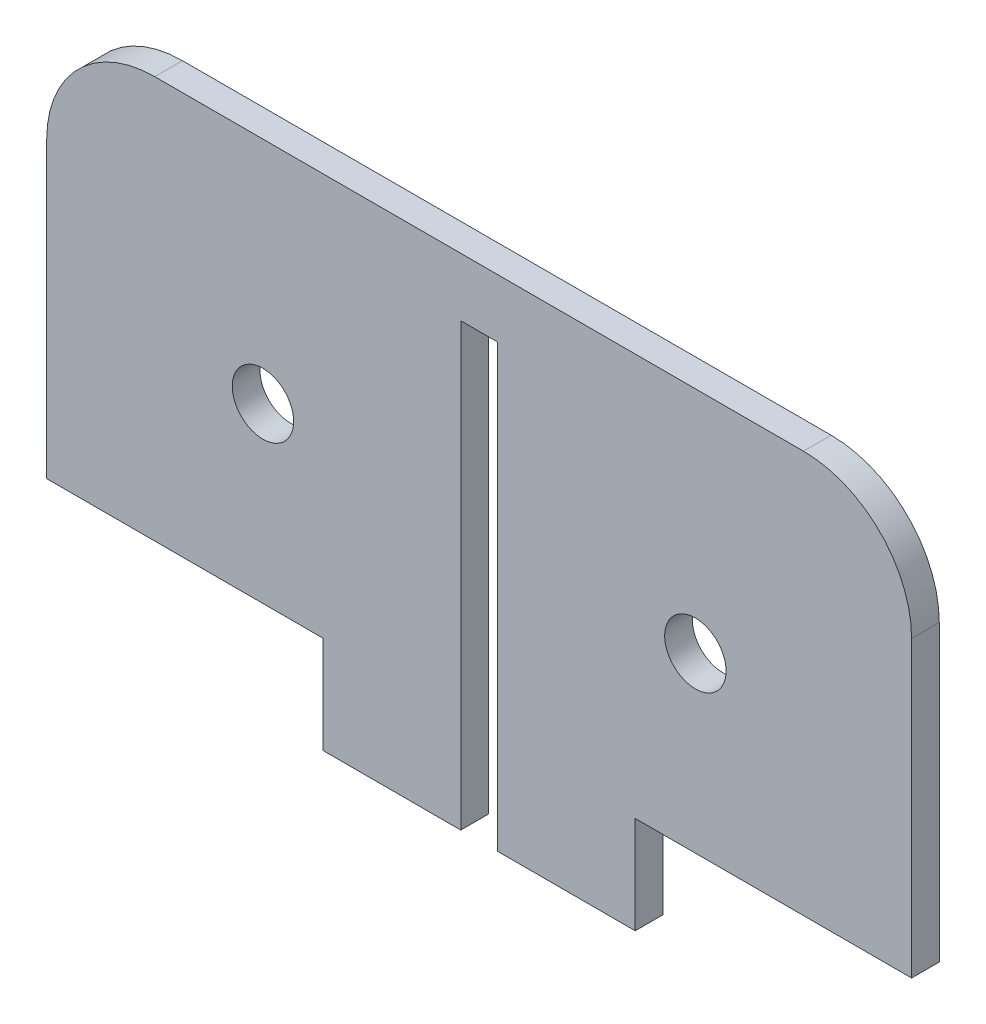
ISO-10303-21;
HEADER;
FILE_DESCRIPTION(('STEP AP214'),'2;1');
FILE_NAME('part.step','',(''),(''),'','','');
FILE_SCHEMA(('AUTOMOTIVE_DESIGN { 1 0 10303 214 1 1 1 1 }'));
ENDSEC;
DATA;
#1=APPLICATION_CONTEXT('core data for automotive mechanical design processes');
#2=APPLICATION_PROTOCOL_DEFINITION('international standard','automotive_design',2000,#1);
#3=PRODUCT_CONTEXT('',#1,'mechanical');
#4=PRODUCT('Part','Part','',(#3));
#5=PRODUCT_RELATED_PRODUCT_CATEGORY('part','',(#4));
#6=PRODUCT_DEFINITION_FORMATION('','',#4);
#7=PRODUCT_DEFINITION_CONTEXT('part definition',#1,'design');
#8=PRODUCT_DEFINITION('design','',#6,#7);
#9=PRODUCT_DEFINITION_SHAPE('','',#8);
#10=(LENGTH_UNIT() NAMED_UNIT(*) SI_UNIT(.MILLI.,.METRE.));
#11=(NAMED_UNIT(*) PLANE_ANGLE_UNIT() SI_UNIT($,.RADIAN.));
#12=(NAMED_UNIT(*) SI_UNIT($,.STERADIAN.) SOLID_ANGLE_UNIT());
#13=UNCERTAINTY_MEASURE_WITH_UNIT(LENGTH_MEASURE(1.E-05),#10,'distance_accuracy_value','');
#14=(GEOMETRIC_REPRESENTATION_CONTEXT(3) GLOBAL_UNCERTAINTY_ASSIGNED_CONTEXT((#13)) GLOBAL_UNIT_ASSIGNED_CONTEXT((#10,
#11,#12)) REPRESENTATION_CONTEXT('',''));
#15=CARTESIAN_POINT('',(0.,0.,0.));
#16=DIRECTION('',(0.,0.,1.));
#17=DIRECTION('',(1.,0.,0.));
#18=AXIS2_PLACEMENT_3D('',#15,#16,#17);
#19=CARTESIAN_POINT('',(63.90625,22.5,-6.4));
#20=DIRECTION('',(0.,-1.,0.));
#21=DIRECTION('',(1.,0.,0.));
#22=AXIS2_PLACEMENT_3D('',#19,#20,#21);
#23=PLANE('',#22);
#24=DIRECTION('',(1.,0.,0.));
#25=VECTOR('',#24,1.);
#26=CARTESIAN_POINT('',(63.90625,22.5,0.));
#27=LINE('',#26,#25);
#28=CARTESIAN_POINT('',(0.,22.5,0.));
#29=VERTEX_POINT('',#28);
#30=CARTESIAN_POINT('',(63.90625,22.5,0.));
#31=VERTEX_POINT('',#30);
#32=EDGE_CURVE('E166',#29,#31,#27,.T.);
#33=ORIENTED_EDGE('',*,*,#32,.F.);
#34=DIRECTION('',(0.,0.,1.));
#35=VECTOR('',#34,1.);
#36=CARTESIAN_POINT('',(0.,22.5,-6.4));
#37=LINE('',#36,#35);
#38=CARTESIAN_POINT('',(0.,22.5,-6.4));
#39=VERTEX_POINT('',#38);
#40=EDGE_CURVE('E11',#39,#29,#37,.T.);
#41=ORIENTED_EDGE('',*,*,#40,.F.);
#42=DIRECTION('',(1.,0.,0.));
#43=VECTOR('',#42,1.);
#44=CARTESIAN_POINT('',(63.90625,22.5,-6.4));
#45=LINE('',#44,#43);
#46=CARTESIAN_POINT('',(63.90625,22.5,-6.4));
#47=VERTEX_POINT('',#46);
#48=EDGE_CURVE('E205',#39,#47,#45,.T.);
#49=ORIENTED_EDGE('',*,*,#48,.T.);
#50=DIRECTION('',(0.,0.,1.));
#51=VECTOR('',#50,1.);
#52=CARTESIAN_POINT('',(63.90625,22.5,-6.4));
#53=LINE('',#52,#51);
#54=EDGE_CURVE('E36',#47,#31,#53,.T.);
#55=ORIENTED_EDGE('',*,*,#54,.T.);
#56=EDGE_LOOP('',(#33,#41,#49,#55));
#57=FACE_BOUND('',#56,.T.);
#58=ADVANCED_FACE('F33',(#57),#23,.T.);
#59=CARTESIAN_POINT('',(0.,22.5,-6.4));
#60=DIRECTION('',(-1.,0.,0.));
#61=DIRECTION('',(0.,-1.,0.));
#62=AXIS2_PLACEMENT_3D('',#59,#60,#61);
#63=PLANE('',#62);
#64=DIRECTION('',(0.,-1.,0.));
#65=VECTOR('',#64,1.);
#66=CARTESIAN_POINT('',(0.,22.5,0.));
#67=LINE('',#66,#65);
#68=CARTESIAN_POINT('',(0.,90.5,0.));
#69=VERTEX_POINT('',#68);
#70=EDGE_CURVE('E203',#69,#29,#67,.T.);
#71=ORIENTED_EDGE('',*,*,#70,.F.);
#72=DIRECTION('',(0.,0.,1.));
#73=VECTOR('',#72,1.);
#74=CARTESIAN_POINT('',(0.,90.5,-6.4));
#75=LINE('',#74,#73);
#76=CARTESIAN_POINT('',(0.,90.5,-6.4));
#77=VERTEX_POINT('',#76);
#78=EDGE_CURVE('E42',#77,#69,#75,.T.);
#79=ORIENTED_EDGE('',*,*,#78,.F.);
#80=DIRECTION('',(0.,-1.,0.));
#81=VECTOR('',#80,1.);
#82=CARTESIAN_POINT('',(0.,22.5,-6.4));
#83=LINE('',#82,#81);
#84=EDGE_CURVE('E156',#77,#39,#83,.T.);
#85=ORIENTED_EDGE('',*,*,#84,.T.);
#86=ORIENTED_EDGE('',*,*,#40,.T.);
#87=EDGE_LOOP('',(#71,#79,#85,#86));
#88=FACE_BOUND('',#87,.T.);
#89=ADVANCED_FACE('F229',(#88),#63,.T.);
#90=CARTESIAN_POINT('',(25.0000001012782,90.4999998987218,-6.4));
#91=DIRECTION('',(0.,0.,1.));
#92=DIRECTION('',(1.,0.,0.));
#93=AXIS2_PLACEMENT_3D('',#90,#91,#92);
#94=CYLINDRICAL_SURFACE('',#93,25.0000001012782);
#95=CARTESIAN_POINT('',(25.0000001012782,90.4999998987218,0.));
#96=DIRECTION('',(0.,0.,1.));
#97=DIRECTION('',(1.,0.,0.));
#98=AXIS2_PLACEMENT_3D('',#95,#96,#97);
#99=CIRCLE('',#98,25.0000001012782);
#100=CARTESIAN_POINT('',(25.,115.5,0.));
#101=VERTEX_POINT('',#100);
#102=EDGE_CURVE('E143',#101,#69,#99,.T.);
#103=ORIENTED_EDGE('',*,*,#102,.F.);
#104=DIRECTION('',(0.,0.,1.));
#105=VECTOR('',#104,1.);
#106=CARTESIAN_POINT('',(25.,115.5,-6.4));
#107=LINE('',#106,#105);
#108=CARTESIAN_POINT('',(25.,115.5,-6.4));
#109=VERTEX_POINT('',#108);
#110=EDGE_CURVE('E138',#109,#101,#107,.T.);
#111=ORIENTED_EDGE('',*,*,#110,.F.);
#112=CARTESIAN_POINT('',(25.0000001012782,90.4999998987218,-6.4));
#113=DIRECTION('',(0.,0.,1.));
#114=DIRECTION('',(1.,0.,0.));
#115=AXIS2_PLACEMENT_3D('',#112,#113,#114);
#116=CIRCLE('',#115,25.0000001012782);
#117=EDGE_CURVE('E141',#109,#77,#116,.T.);
#118=ORIENTED_EDGE('',*,*,#117,.T.);
#119=ORIENTED_EDGE('',*,*,#78,.T.);
#120=EDGE_LOOP('',(#103,#111,#118,#119));
#121=FACE_BOUND('',#120,.T.);
#122=ADVANCED_FACE('F140',(#121),#94,.T.);
#123=CARTESIAN_POINT('',(25.,115.5,-6.4));
#124=DIRECTION('',(0.,1.,0.));
#125=DIRECTION('',(0.,0.,1.));
#126=AXIS2_PLACEMENT_3D('',#123,#124,#125);
#127=PLANE('',#126);
#128=DIRECTION('',(-1.,0.,0.));
#129=VECTOR('',#128,1.);
#130=CARTESIAN_POINT('',(25.,115.5,0.));
#131=LINE('',#130,#129);
#132=CARTESIAN_POINT('',(175.,115.5,0.));
#133=VERTEX_POINT('',#132);
#134=EDGE_CURVE('E200',#133,#101,#131,.T.);
#135=ORIENTED_EDGE('',*,*,#134,.F.);
#136=DIRECTION('',(0.,0.,1.));
#137=VECTOR('',#136,1.);
#138=CARTESIAN_POINT('',(175.,115.5,-6.4));
#139=LINE('',#138,#137);
#140=CARTESIAN_POINT('',(175.,115.5,-6.4));
#141=VERTEX_POINT('',#140);
#142=EDGE_CURVE('E148',#141,#133,#139,.T.);
#143=ORIENTED_EDGE('',*,*,#142,.F.);
#144=DIRECTION('',(-1.,0.,0.));
#145=VECTOR('',#144,1.);
#146=CARTESIAN_POINT('',(25.,115.5,-6.4));
#147=LINE('',#146,#145);
#148=EDGE_CURVE('E154',#141,#109,#147,.T.);
#149=ORIENTED_EDGE('',*,*,#148,.T.);
#150=ORIENTED_EDGE('',*,*,#110,.T.);
#151=EDGE_LOOP('',(#135,#143,#149,#150));
#152=FACE_BOUND('',#151,.T.);
#153=ADVANCED_FACE('F158',(#152),#127,.T.);
#154=CARTESIAN_POINT('',(174.999999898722,90.4999998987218,-6.4));
#155=DIRECTION('',(0.,0.,1.));
#156=DIRECTION('',(1.,0.,0.));
#157=AXIS2_PLACEMENT_3D('',#154,#155,#156);
#158=CYLINDRICAL_SURFACE('',#157,25.0000001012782);
#159=CARTESIAN_POINT('',(174.999999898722,90.4999998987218,0.));
#160=DIRECTION('',(0.,0.,1.));
#161=DIRECTION('',(1.,0.,0.));
#162=AXIS2_PLACEMENT_3D('',#159,#160,#161);
#163=CIRCLE('',#162,25.0000001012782);
#164=CARTESIAN_POINT('',(200.,90.5,0.));
#165=VERTEX_POINT('',#164);
#166=EDGE_CURVE('E197',#165,#133,#163,.T.);
#167=ORIENTED_EDGE('',*,*,#166,.F.);
#168=DIRECTION('',(0.,0.,1.));
#169=VECTOR('',#168,1.);
#170=CARTESIAN_POINT('',(200.,90.5,-6.4));
#171=LINE('',#170,#169);
#172=CARTESIAN_POINT('',(200.,90.5,-6.4));
#173=VERTEX_POINT('',#172);
#174=EDGE_CURVE('E209',#173,#165,#171,.T.);
#175=ORIENTED_EDGE('',*,*,#174,.F.);
#176=CARTESIAN_POINT('',(174.999999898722,90.4999998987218,-6.4));
#177=DIRECTION('',(0.,0.,1.));
#178=DIRECTION('',(1.,0.,0.));
#179=AXIS2_PLACEMENT_3D('',#176,#177,#178);
#180=CIRCLE('',#179,25.0000001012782);
#181=EDGE_CURVE('E159',#173,#141,#180,.T.);
#182=ORIENTED_EDGE('',*,*,#181,.T.);
#183=ORIENTED_EDGE('',*,*,#142,.T.);
#184=EDGE_LOOP('',(#167,#175,#182,#183));
#185=FACE_BOUND('',#184,.T.);
#186=ADVANCED_FACE('F242',(#185),#158,.T.);
#187=CARTESIAN_POINT('',(200.,90.5,-6.4));
#188=DIRECTION('',(1.,0.,0.));
#189=DIRECTION('',(0.,0.,-1.));
#190=AXIS2_PLACEMENT_3D('',#187,#188,#189);
#191=PLANE('',#190);
#192=DIRECTION('',(0.,1.,0.));
#193=VECTOR('',#192,1.);
#194=CARTESIAN_POINT('',(200.,90.5,0.));
#195=LINE('',#194,#193);
#196=CARTESIAN_POINT('',(200.,22.5,0.));
#197=VERTEX_POINT('',#196);
#198=EDGE_CURVE('E194',#197,#165,#195,.T.);
#199=ORIENTED_EDGE('',*,*,#198,.F.);
#200=DIRECTION('',(0.,0.,1.));
#201=VECTOR('',#200,1.);
#202=CARTESIAN_POINT('',(200.,22.5,-6.4));
#203=LINE('',#202,#201);
#204=CARTESIAN_POINT('',(200.,22.5,-6.4));
#205=VERTEX_POINT('',#204);
#206=EDGE_CURVE('E211',#205,#197,#203,.T.);
#207=ORIENTED_EDGE('',*,*,#206,.F.);
#208=DIRECTION('',(0.,1.,0.));
#209=VECTOR('',#208,1.);
#210=CARTESIAN_POINT('',(200.,90.5,-6.4));
#211=LINE('',#210,#209);
#212=EDGE_CURVE('E161',#205,#173,#211,.T.);
#213=ORIENTED_EDGE('',*,*,#212,.T.);
#214=ORIENTED_EDGE('',*,*,#174,.T.);
#215=EDGE_LOOP('',(#199,#207,#213,#214));
#216=FACE_BOUND('',#215,.T.);
#217=ADVANCED_FACE('F245',(#216),#191,.T.);
#218=CARTESIAN_POINT('',(200.,22.5,-6.4));
#219=DIRECTION('',(0.,-1.,0.));
#220=DIRECTION('',(1.,0.,0.));
#221=AXIS2_PLACEMENT_3D('',#218,#219,#220);
#222=PLANE('',#221);
#223=DIRECTION('',(1.,0.,0.));
#224=VECTOR('',#223,1.);
#225=CARTESIAN_POINT('',(200.,22.5,0.));
#226=LINE('',#225,#224);
#227=CARTESIAN_POINT('',(136.09375,22.5,0.));
#228=VERTEX_POINT('',#227);
#229=EDGE_CURVE('E191',#228,#197,#226,.T.);
#230=ORIENTED_EDGE('',*,*,#229,.F.);
#231=DIRECTION('',(0.,0.,1.));
#232=VECTOR('',#231,1.);
#233=CARTESIAN_POINT('',(136.09375,22.5,-6.4));
#234=LINE('',#233,#232);
#235=CARTESIAN_POINT('',(136.09375,22.5,-6.4));
#236=VERTEX_POINT('',#235);
#237=EDGE_CURVE('E213',#236,#228,#234,.T.);
#238=ORIENTED_EDGE('',*,*,#237,.F.);
#239=DIRECTION('',(1.,0.,0.));
#240=VECTOR('',#239,1.);
#241=CARTESIAN_POINT('',(200.,22.5,-6.4));
#242=LINE('',#241,#240);
#243=EDGE_CURVE('E333',#236,#205,#242,.T.);
#244=ORIENTED_EDGE('',*,*,#243,.T.);
#245=ORIENTED_EDGE('',*,*,#206,.T.);
#246=EDGE_LOOP('',(#230,#238,#244,#245));
#247=FACE_BOUND('',#246,.T.);
#248=ADVANCED_FACE('F249',(#247),#222,.T.);
#249=CARTESIAN_POINT('',(136.09375,22.5,-6.4));
#250=DIRECTION('',(1.,0.,0.));
#251=DIRECTION('',(0.,0.,-1.));
#252=AXIS2_PLACEMENT_3D('',#249,#250,#251);
#253=PLANE('',#252);
#254=DIRECTION('',(0.,1.,0.));
#255=VECTOR('',#254,1.);
#256=CARTESIAN_POINT('',(136.09375,22.5,0.));
#257=LINE('',#256,#255);
#258=CARTESIAN_POINT('',(136.09375,0.,0.));
#259=VERTEX_POINT('',#258);
#260=EDGE_CURVE('E188',#259,#228,#257,.T.);
#261=ORIENTED_EDGE('',*,*,#260,.F.);
#262=DIRECTION('',(0.,0.,1.));
#263=VECTOR('',#262,1.);
#264=CARTESIAN_POINT('',(136.09375,0.,-6.4));
#265=LINE('',#264,#263);
#266=CARTESIAN_POINT('',(136.09375,0.,-6.4));
#267=VERTEX_POINT('',#266);
#268=EDGE_CURVE('E215',#267,#259,#265,.T.);
#269=ORIENTED_EDGE('',*,*,#268,.F.);
#270=DIRECTION('',(0.,1.,0.));
#271=VECTOR('',#270,1.);
#272=CARTESIAN_POINT('',(136.09375,22.5,-6.4));
#273=LINE('',#272,#271);
#274=EDGE_CURVE('E330',#267,#236,#273,.T.);
#275=ORIENTED_EDGE('',*,*,#274,.T.);
#276=ORIENTED_EDGE('',*,*,#237,.T.);
#277=EDGE_LOOP('',(#261,#269,#275,#276));
#278=FACE_BOUND('',#277,.T.);
#279=ADVANCED_FACE('F253',(#278),#253,.T.);
#280=CARTESIAN_POINT('',(136.09375,0.,-6.4));
#281=DIRECTION('',(0.,-1.,0.));
#282=DIRECTION('',(1.,0.,0.));
#283=AXIS2_PLACEMENT_3D('',#280,#281,#282);
#284=PLANE('',#283);
#285=DIRECTION('',(1.,0.,0.));
#286=VECTOR('',#285,1.);
#287=CARTESIAN_POINT('',(136.09375,0.,0.));
#288=LINE('',#287,#286);
#289=CARTESIAN_POINT('',(104.25,0.,0.));
#290=VERTEX_POINT('',#289);
#291=EDGE_CURVE('E185',#290,#259,#288,.T.);
#292=ORIENTED_EDGE('',*,*,#291,.F.);
#293=DIRECTION('',(0.,0.,1.));
#294=VECTOR('',#293,1.);
#295=CARTESIAN_POINT('',(104.25,0.,-6.4));
#296=LINE('',#295,#294);
#297=CARTESIAN_POINT('',(104.25,0.,-6.4));
#298=VERTEX_POINT('',#297);
#299=EDGE_CURVE('E217',#298,#290,#296,.T.);
#300=ORIENTED_EDGE('',*,*,#299,.F.);
#301=DIRECTION('',(1.,0.,0.));
#302=VECTOR('',#301,1.);
#303=CARTESIAN_POINT('',(136.09375,0.,-6.4));
#304=LINE('',#303,#302);
#305=EDGE_CURVE('E327',#298,#267,#304,.T.);
#306=ORIENTED_EDGE('',*,*,#305,.T.);
#307=ORIENTED_EDGE('',*,*,#268,.T.);
#308=EDGE_LOOP('',(#292,#300,#306,#307));
#309=FACE_BOUND('',#308,.T.);
#310=ADVANCED_FACE('F257',(#309),#284,.T.);
#311=CARTESIAN_POINT('',(104.25,0.,-6.4));
#312=DIRECTION('',(-1.,0.,0.));
#313=DIRECTION('',(0.,-1.,0.));
#314=AXIS2_PLACEMENT_3D('',#311,#312,#313);
#315=PLANE('',#314);
#316=DIRECTION('',(0.,-1.,0.));
#317=VECTOR('',#316,1.);
#318=CARTESIAN_POINT('',(104.25,0.,0.));
#319=LINE('',#318,#317);
#320=CARTESIAN_POINT('',(104.25,102.,0.));
#321=VERTEX_POINT('',#320);
#322=EDGE_CURVE('E182',#321,#290,#319,.T.);
#323=ORIENTED_EDGE('',*,*,#322,.F.);
#324=DIRECTION('',(0.,0.,1.));
#325=VECTOR('',#324,1.);
#326=CARTESIAN_POINT('',(104.25,102.,-6.4));
#327=LINE('',#326,#325);
#328=CARTESIAN_POINT('',(104.25,102.,-6.4));
#329=VERTEX_POINT('',#328);
#330=EDGE_CURVE('E219',#329,#321,#327,.T.);
#331=ORIENTED_EDGE('',*,*,#330,.F.);
#332=DIRECTION('',(0.,-1.,0.));
#333=VECTOR('',#332,1.);
#334=CARTESIAN_POINT('',(104.25,0.,-6.4));
#335=LINE('',#334,#333);
#336=EDGE_CURVE('E324',#329,#298,#335,.T.);
#337=ORIENTED_EDGE('',*,*,#336,.T.);
#338=ORIENTED_EDGE('',*,*,#299,.T.);
#339=EDGE_LOOP('',(#323,#331,#337,#338));
#340=FACE_BOUND('',#339,.T.);
#341=ADVANCED_FACE('F261',(#340),#315,.T.);
#342=CARTESIAN_POINT('',(104.25,102.,-6.4));
#343=DIRECTION('',(0.,-1.,0.));
#344=DIRECTION('',(0.,0.,-1.));
#345=AXIS2_PLACEMENT_3D('',#342,#343,#344);
#346=PLANE('',#345);
#347=DIRECTION('',(1.,0.,0.));
#348=VECTOR('',#347,1.);
#349=CARTESIAN_POINT('',(104.25,102.,0.));
#350=LINE('',#349,#348);
#351=CARTESIAN_POINT('',(95.7500000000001,102.,0.));
#352=VERTEX_POINT('',#351);
#353=EDGE_CURVE('E179',#352,#321,#350,.T.);
#354=ORIENTED_EDGE('',*,*,#353,.F.);
#355=DIRECTION('',(0.,0.,1.));
#356=VECTOR('',#355,1.);
#357=CARTESIAN_POINT('',(95.7500000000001,102.,-6.4));
#358=LINE('',#357,#356);
#359=CARTESIAN_POINT('',(95.7500000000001,102.,-6.4));
#360=VERTEX_POINT('',#359);
#361=EDGE_CURVE('E221',#360,#352,#358,.T.);
#362=ORIENTED_EDGE('',*,*,#361,.F.);
#363=DIRECTION('',(1.,0.,0.));
#364=VECTOR('',#363,1.);
#365=CARTESIAN_POINT('',(104.25,102.,-6.4));
#366=LINE('',#365,#364);
#367=EDGE_CURVE('E321',#360,#329,#366,.T.);
#368=ORIENTED_EDGE('',*,*,#367,.T.);
#369=ORIENTED_EDGE('',*,*,#330,.T.);
#370=EDGE_LOOP('',(#354,#362,#368,#369));
#371=FACE_BOUND('',#370,.T.);
#372=ADVANCED_FACE('F265',(#371),#346,.T.);
#373=CARTESIAN_POINT('',(95.7500000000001,102.,-6.4));
#374=DIRECTION('',(1.,0.,0.));
#375=DIRECTION('',(0.,0.,-1.));
#376=AXIS2_PLACEMENT_3D('',#373,#374,#375);
#377=PLANE('',#376);
#378=DIRECTION('',(0.,1.,0.));
#379=VECTOR('',#378,1.);
#380=CARTESIAN_POINT('',(95.7500000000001,102.,0.));
#381=LINE('',#380,#379);
#382=CARTESIAN_POINT('',(95.7500000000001,0.,0.));
#383=VERTEX_POINT('',#382);
#384=EDGE_CURVE('E176',#383,#352,#381,.T.);
#385=ORIENTED_EDGE('',*,*,#384,.F.);
#386=DIRECTION('',(0.,0.,1.));
#387=VECTOR('',#386,1.);
#388=CARTESIAN_POINT('',(95.7500000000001,0.,-6.4));
#389=LINE('',#388,#387);
#390=CARTESIAN_POINT('',(95.7500000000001,0.,-6.4));
#391=VERTEX_POINT('',#390);
#392=EDGE_CURVE('E223',#391,#383,#389,.T.);
#393=ORIENTED_EDGE('',*,*,#392,.F.);
#394=DIRECTION('',(0.,1.,0.));
#395=VECTOR('',#394,1.);
#396=CARTESIAN_POINT('',(95.7500000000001,102.,-6.4));
#397=LINE('',#396,#395);
#398=EDGE_CURVE('E318',#391,#360,#397,.T.);
#399=ORIENTED_EDGE('',*,*,#398,.T.);
#400=ORIENTED_EDGE('',*,*,#361,.T.);
#401=EDGE_LOOP('',(#385,#393,#399,#400));
#402=FACE_BOUND('',#401,.T.);
#403=ADVANCED_FACE('F269',(#402),#377,.T.);
#404=CARTESIAN_POINT('',(95.7500000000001,0.,-6.4));
#405=DIRECTION('',(0.,-1.,0.));
#406=DIRECTION('',(1.,0.,0.));
#407=AXIS2_PLACEMENT_3D('',#404,#405,#406);
#408=PLANE('',#407);
#409=DIRECTION('',(1.,0.,0.));
#410=VECTOR('',#409,1.);
#411=CARTESIAN_POINT('',(95.7500000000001,0.,0.));
#412=LINE('',#411,#410);
#413=CARTESIAN_POINT('',(63.90625,0.,0.));
#414=VERTEX_POINT('',#413);
#415=EDGE_CURVE('E173',#414,#383,#412,.T.);
#416=ORIENTED_EDGE('',*,*,#415,.F.);
#417=DIRECTION('',(0.,0.,1.));
#418=VECTOR('',#417,1.);
#419=CARTESIAN_POINT('',(63.90625,0.,-6.4));
#420=LINE('',#419,#418);
#421=CARTESIAN_POINT('',(63.90625,0.,-6.4));
#422=VERTEX_POINT('',#421);
#423=EDGE_CURVE('E224',#422,#414,#420,.T.);
#424=ORIENTED_EDGE('',*,*,#423,.F.);
#425=DIRECTION('',(1.,0.,0.));
#426=VECTOR('',#425,1.);
#427=CARTESIAN_POINT('',(95.7500000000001,0.,-6.4));
#428=LINE('',#427,#426);
#429=EDGE_CURVE('E315',#422,#391,#428,.T.);
#430=ORIENTED_EDGE('',*,*,#429,.T.);
#431=ORIENTED_EDGE('',*,*,#392,.T.);
#432=EDGE_LOOP('',(#416,#424,#430,#431));
#433=FACE_BOUND('',#432,.T.);
#434=ADVANCED_FACE('F273',(#433),#408,.T.);
#435=CARTESIAN_POINT('',(63.90625,0.,-6.4));
#436=DIRECTION('',(-1.,0.,0.));
#437=DIRECTION('',(0.,0.,1.));
#438=AXIS2_PLACEMENT_3D('',#435,#436,#437);
#439=PLANE('',#438);
#440=DIRECTION('',(0.,-1.,0.));
#441=VECTOR('',#440,1.);
#442=CARTESIAN_POINT('',(63.90625,0.,0.));
#443=LINE('',#442,#441);
#444=EDGE_CURVE('E169',#31,#414,#443,.T.);
#445=ORIENTED_EDGE('',*,*,#444,.F.);
#446=ORIENTED_EDGE('',*,*,#54,.F.);
#447=DIRECTION('',(0.,-1.,0.));
#448=VECTOR('',#447,1.);
#449=CARTESIAN_POINT('',(63.90625,0.,-6.4));
#450=LINE('',#449,#448);
#451=EDGE_CURVE('E313',#47,#422,#450,.T.);
#452=ORIENTED_EDGE('',*,*,#451,.T.);
#453=ORIENTED_EDGE('',*,*,#423,.T.);
#454=EDGE_LOOP('',(#445,#446,#452,#453));
#455=FACE_BOUND('',#454,.T.);
#456=ADVANCED_FACE('F226',(#455),#439,.T.);
#457=CARTESIAN_POINT('',(25.0000001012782,90.4999998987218,-6.4));
#458=DIRECTION('',(0.,0.,1.));
#459=DIRECTION('',(1.,0.,0.));
#460=AXIS2_PLACEMENT_3D('',#457,#458,#459);
#461=PLANE('',#460);
#462=CARTESIAN_POINT('',(150.,62.5,-6.4));
#463=DIRECTION('',(0.,0.,1.));
#464=DIRECTION('',(1.,0.,0.));
#465=AXIS2_PLACEMENT_3D('',#462,#463,#464);
#466=CIRCLE('',#465,7.1);
#467=CARTESIAN_POINT('',(157.1,62.5,-6.4));
#468=VERTEX_POINT('',#467);
#469=EDGE_CURVE('E300',#468,#468,#466,.T.);
#470=ORIENTED_EDGE('',*,*,#469,.T.);
#471=EDGE_LOOP('',(#470));
#472=FACE_BOUND('',#471,.T.);
#473=CARTESIAN_POINT('',(50.,62.5,-6.4));
#474=DIRECTION('',(0.,0.,1.));
#475=DIRECTION('',(1.,0.,0.));
#476=AXIS2_PLACEMENT_3D('',#473,#474,#475);
#477=CIRCLE('',#476,7.1);
#478=CARTESIAN_POINT('',(57.1,62.5,-6.4));
#479=VERTEX_POINT('',#478);
#480=EDGE_CURVE('E170',#479,#479,#477,.T.);
#481=ORIENTED_EDGE('',*,*,#480,.T.);
#482=EDGE_LOOP('',(#481));
#483=FACE_BOUND('',#482,.T.);
#484=ORIENTED_EDGE('',*,*,#48,.F.);
#485=ORIENTED_EDGE('',*,*,#84,.F.);
#486=ORIENTED_EDGE('',*,*,#117,.F.);
#487=ORIENTED_EDGE('',*,*,#148,.F.);
#488=ORIENTED_EDGE('',*,*,#181,.F.);
#489=ORIENTED_EDGE('',*,*,#212,.F.);
#490=ORIENTED_EDGE('',*,*,#243,.F.);
#491=ORIENTED_EDGE('',*,*,#274,.F.);
#492=ORIENTED_EDGE('',*,*,#305,.F.);
#493=ORIENTED_EDGE('',*,*,#336,.F.);
#494=ORIENTED_EDGE('',*,*,#367,.F.);
#495=ORIENTED_EDGE('',*,*,#398,.F.);
#496=ORIENTED_EDGE('',*,*,#429,.F.);
#497=ORIENTED_EDGE('',*,*,#451,.F.);
#498=EDGE_LOOP('',(#484,#485,#486,#487,#488,#489,#490,#491,#492,#493,#494,#495,#496,#497));
#499=FACE_BOUND('',#498,.T.);
#500=ADVANCED_FACE('F152',(#472,#483,#499),#461,.F.);
#501=CARTESIAN_POINT('',(25.0000001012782,90.4999998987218,0.));
#502=DIRECTION('',(0.,0.,1.));
#503=DIRECTION('',(1.,0.,0.));
#504=AXIS2_PLACEMENT_3D('',#501,#502,#503);
#505=PLANE('',#504);
#506=CARTESIAN_POINT('',(150.,62.5,0.));
#507=DIRECTION('',(0.,0.,1.));
#508=DIRECTION('',(1.,0.,0.));
#509=AXIS2_PLACEMENT_3D('',#506,#507,#508);
#510=CIRCLE('',#509,7.1);
#511=CARTESIAN_POINT('',(157.1,62.5,0.));
#512=VERTEX_POINT('',#511);
#513=EDGE_CURVE('E303',#512,#512,#510,.T.);
#514=ORIENTED_EDGE('',*,*,#513,.F.);
#515=EDGE_LOOP('',(#514));
#516=FACE_BOUND('',#515,.T.);
#517=CARTESIAN_POINT('',(50.,62.5,0.));
#518=DIRECTION('',(0.,0.,1.));
#519=DIRECTION('',(1.,0.,0.));
#520=AXIS2_PLACEMENT_3D('',#517,#518,#519);
#521=CIRCLE('',#520,7.1);
#522=CARTESIAN_POINT('',(57.1,62.5,0.));
#523=VERTEX_POINT('',#522);
#524=EDGE_CURVE('E305',#523,#523,#521,.T.);
#525=ORIENTED_EDGE('',*,*,#524,.F.);
#526=EDGE_LOOP('',(#525));
#527=FACE_BOUND('',#526,.T.);
#528=ORIENTED_EDGE('',*,*,#32,.T.);
#529=ORIENTED_EDGE('',*,*,#444,.T.);
#530=ORIENTED_EDGE('',*,*,#415,.T.);
#531=ORIENTED_EDGE('',*,*,#384,.T.);
#532=ORIENTED_EDGE('',*,*,#353,.T.);
#533=ORIENTED_EDGE('',*,*,#322,.T.);
#534=ORIENTED_EDGE('',*,*,#291,.T.);
#535=ORIENTED_EDGE('',*,*,#260,.T.);
#536=ORIENTED_EDGE('',*,*,#229,.T.);
#537=ORIENTED_EDGE('',*,*,#198,.T.);
#538=ORIENTED_EDGE('',*,*,#166,.T.);
#539=ORIENTED_EDGE('',*,*,#134,.T.);
#540=ORIENTED_EDGE('',*,*,#102,.T.);
#541=ORIENTED_EDGE('',*,*,#70,.T.);
#542=EDGE_LOOP('',(#528,#529,#530,#531,#532,#533,#534,#535,#536,#537,#538,#539,#540,#541));
#543=FACE_BOUND('',#542,.T.);
#544=ADVANCED_FACE('F228',(#516,#527,#543),#505,.T.);
#545=CARTESIAN_POINT('',(50.,62.5,-6.4));
#546=DIRECTION('',(0.,0.,1.));
#547=DIRECTION('',(1.,0.,0.));
#548=AXIS2_PLACEMENT_3D('',#545,#546,#547);
#549=CYLINDRICAL_SURFACE('',#548,7.1);
#550=ORIENTED_EDGE('',*,*,#480,.F.);
#551=EDGE_LOOP('',(#550));
#552=FACE_BOUND('',#551,.T.);
#553=ORIENTED_EDGE('',*,*,#524,.T.);
#554=EDGE_LOOP('',(#553));
#555=FACE_BOUND('',#554,.T.);
#556=ADVANCED_FACE('F285',(#552,#555),#549,.F.);
#557=CARTESIAN_POINT('',(150.,62.5,-6.4));
#558=DIRECTION('',(0.,0.,1.));
#559=DIRECTION('',(1.,0.,0.));
#560=AXIS2_PLACEMENT_3D('',#557,#558,#559);
#561=CYLINDRICAL_SURFACE('',#560,7.1);
#562=ORIENTED_EDGE('',*,*,#469,.F.);
#563=EDGE_LOOP('',(#562));
#564=FACE_BOUND('',#563,.T.);
#565=ORIENTED_EDGE('',*,*,#513,.T.);
#566=EDGE_LOOP('',(#565));
#567=FACE_BOUND('',#566,.T.);
#568=ADVANCED_FACE('F292',(#564,#567),#561,.F.);
#569=CLOSED_SHELL('',(#58,#89,#122,#153,#186,#217,#248,#279,#310,#341,#372,#403,#434,#456,#500,
#544,#556,#568));
#570=MANIFOLD_SOLID_BREP('B2',#569);
#571=ADVANCED_BREP_SHAPE_REPRESENTATION('',(#18,#570),#14);
#572=SHAPE_DEFINITION_REPRESENTATION(#9,#571);
ENDSEC;
END-ISO-10303-21;
